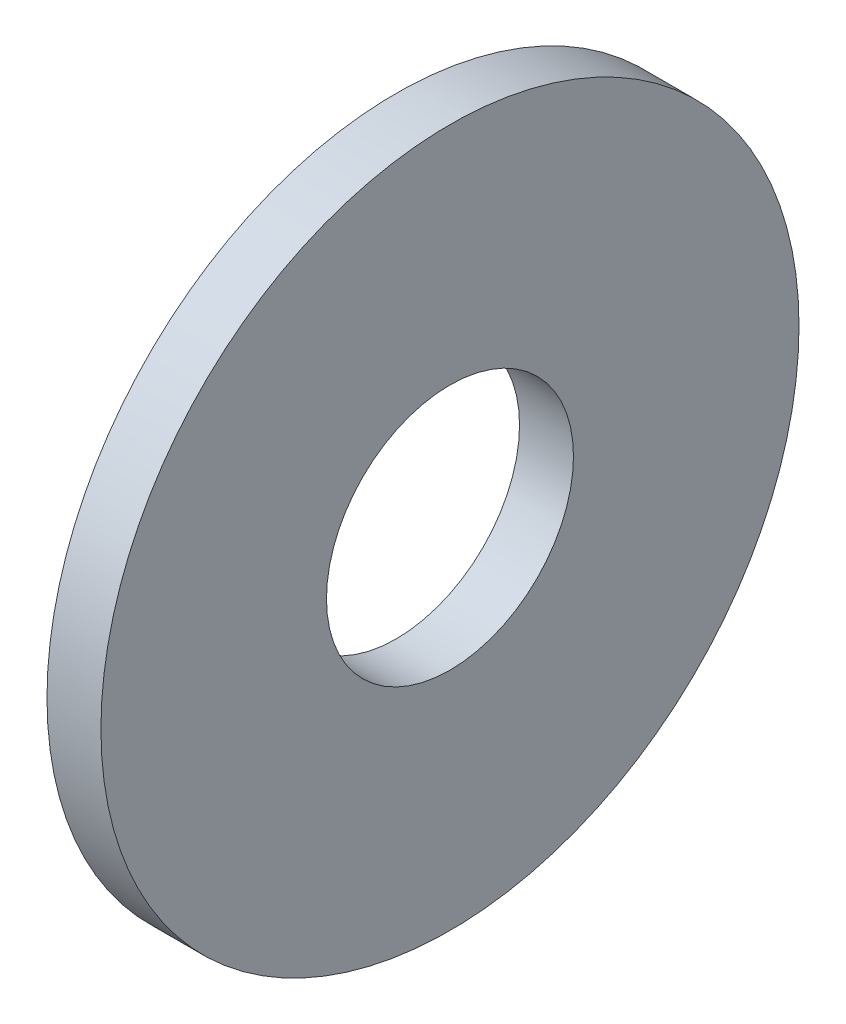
ISO-10303-21;
HEADER;
FILE_DESCRIPTION(('STEP AP214'),'2;1');
FILE_NAME('part.step','',(''),(''),'','','');
FILE_SCHEMA(('AUTOMOTIVE_DESIGN { 1 0 10303 214 1 1 1 1 }'));
ENDSEC;
DATA;
#1=APPLICATION_CONTEXT('core data for automotive mechanical design processes');
#2=APPLICATION_PROTOCOL_DEFINITION('international standard','automotive_design',2000,#1);
#3=PRODUCT_CONTEXT('',#1,'mechanical');
#4=PRODUCT('Part','Part','',(#3));
#5=PRODUCT_RELATED_PRODUCT_CATEGORY('part','',(#4));
#6=PRODUCT_DEFINITION_FORMATION('','',#4);
#7=PRODUCT_DEFINITION_CONTEXT('part definition',#1,'design');
#8=PRODUCT_DEFINITION('design','',#6,#7);
#9=PRODUCT_DEFINITION_SHAPE('','',#8);
#10=(LENGTH_UNIT() NAMED_UNIT(*) SI_UNIT(.MILLI.,.METRE.));
#11=(NAMED_UNIT(*) PLANE_ANGLE_UNIT() SI_UNIT($,.RADIAN.));
#12=(NAMED_UNIT(*) SI_UNIT($,.STERADIAN.) SOLID_ANGLE_UNIT());
#13=UNCERTAINTY_MEASURE_WITH_UNIT(LENGTH_MEASURE(1.E-05),#10,'distance_accuracy_value','');
#14=(GEOMETRIC_REPRESENTATION_CONTEXT(3) GLOBAL_UNCERTAINTY_ASSIGNED_CONTEXT((#13)) GLOBAL_UNIT_ASSIGNED_CONTEXT((#10,
#11,#12)) REPRESENTATION_CONTEXT('',''));
#15=CARTESIAN_POINT('',(0.,0.,0.));
#16=DIRECTION('',(0.,0.,1.));
#17=DIRECTION('',(1.,0.,0.));
#18=AXIS2_PLACEMENT_3D('',#15,#16,#17);
#19=CARTESIAN_POINT('',(-34.9249999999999,0.,0.));
#20=DIRECTION('',(-1.,0.,0.));
#21=DIRECTION('',(0.,0.,1.));
#22=AXIS2_PLACEMENT_3D('',#19,#20,#21);
#23=CYLINDRICAL_SURFACE('',#22,19.46);
#24=CARTESIAN_POINT('',(0.,0.,0.));
#25=DIRECTION('',(-1.,0.,0.));
#26=DIRECTION('',(0.,0.,1.));
#27=AXIS2_PLACEMENT_3D('',#24,#25,#26);
#28=CIRCLE('',#27,19.46);
#29=CARTESIAN_POINT('',(0.,0.,19.46));
#30=VERTEX_POINT('',#29);
#31=EDGE_CURVE('E10',#30,#30,#28,.T.);
#32=ORIENTED_EDGE('',*,*,#31,.F.);
#33=EDGE_LOOP('',(#32));
#34=FACE_BOUND('',#33,.T.);
#35=CARTESIAN_POINT('',(-8.5,0.,0.));
#36=DIRECTION('',(-1.,0.,0.));
#37=DIRECTION('',(0.,0.,1.));
#38=AXIS2_PLACEMENT_3D('',#35,#36,#37);
#39=CIRCLE('',#38,19.46);
#40=CARTESIAN_POINT('',(-8.5,0.,19.46));
#41=VERTEX_POINT('',#40);
#42=EDGE_CURVE('E45',#41,#41,#39,.T.);
#43=ORIENTED_EDGE('',*,*,#42,.T.);
#44=EDGE_LOOP('',(#43));
#45=FACE_BOUND('',#44,.T.);
#46=ADVANCED_FACE('F31',(#34,#45),#23,.F.);
#47=CARTESIAN_POINT('',(0.,19.46,0.));
#48=DIRECTION('',(-1.,0.,0.));
#49=DIRECTION('',(0.,0.,1.));
#50=AXIS2_PLACEMENT_3D('',#47,#48,#49);
#51=PLANE('',#50);
#52=CARTESIAN_POINT('',(0.,0.,0.));
#53=DIRECTION('',(-1.,0.,0.));
#54=DIRECTION('',(0.,0.,1.));
#55=AXIS2_PLACEMENT_3D('',#52,#53,#54);
#56=CIRCLE('',#55,55.);
#57=CARTESIAN_POINT('',(0.,0.,55.));
#58=VERTEX_POINT('',#57);
#59=EDGE_CURVE('E37',#58,#58,#56,.T.);
#60=ORIENTED_EDGE('',*,*,#59,.F.);
#61=EDGE_LOOP('',(#60));
#62=FACE_BOUND('',#61,.T.);
#63=ORIENTED_EDGE('',*,*,#31,.T.);
#64=EDGE_LOOP('',(#63));
#65=FACE_BOUND('',#64,.T.);
#66=ADVANCED_FACE('F60',(#62,#65),#51,.F.);
#67=CARTESIAN_POINT('',(-34.9249999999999,0.,0.));
#68=DIRECTION('',(-1.,0.,0.));
#69=DIRECTION('',(0.,0.,1.));
#70=AXIS2_PLACEMENT_3D('',#67,#68,#69);
#71=CYLINDRICAL_SURFACE('',#70,55.);
#72=CARTESIAN_POINT('',(-8.5,0.,0.));
#73=DIRECTION('',(-1.,0.,0.));
#74=DIRECTION('',(0.,0.,1.));
#75=AXIS2_PLACEMENT_3D('',#72,#73,#74);
#76=CIRCLE('',#75,55.);
#77=CARTESIAN_POINT('',(-8.5,0.,55.));
#78=VERTEX_POINT('',#77);
#79=EDGE_CURVE('E41',#78,#78,#76,.T.);
#80=ORIENTED_EDGE('',*,*,#79,.F.);
#81=EDGE_LOOP('',(#80));
#82=FACE_BOUND('',#81,.T.);
#83=ORIENTED_EDGE('',*,*,#59,.T.);
#84=EDGE_LOOP('',(#83));
#85=FACE_BOUND('',#84,.T.);
#86=ADVANCED_FACE('F55',(#82,#85),#71,.T.);
#87=CARTESIAN_POINT('',(-8.5,55.,0.));
#88=DIRECTION('',(1.,0.,0.));
#89=DIRECTION('',(0.,0.,-1.));
#90=AXIS2_PLACEMENT_3D('',#87,#88,#89);
#91=PLANE('',#90);
#92=ORIENTED_EDGE('',*,*,#42,.F.);
#93=EDGE_LOOP('',(#92));
#94=FACE_BOUND('',#93,.T.);
#95=ORIENTED_EDGE('',*,*,#79,.T.);
#96=EDGE_LOOP('',(#95));
#97=FACE_BOUND('',#96,.T.);
#98=ADVANCED_FACE('F52',(#94,#97),#91,.F.);
#99=CLOSED_SHELL('',(#46,#66,#86,#98));
#100=MANIFOLD_SOLID_BREP('B2',#99);
#101=ADVANCED_BREP_SHAPE_REPRESENTATION('',(#18,#100),#14);
#102=SHAPE_DEFINITION_REPRESENTATION(#9,#101);
ENDSEC;
END-ISO-10303-21;
